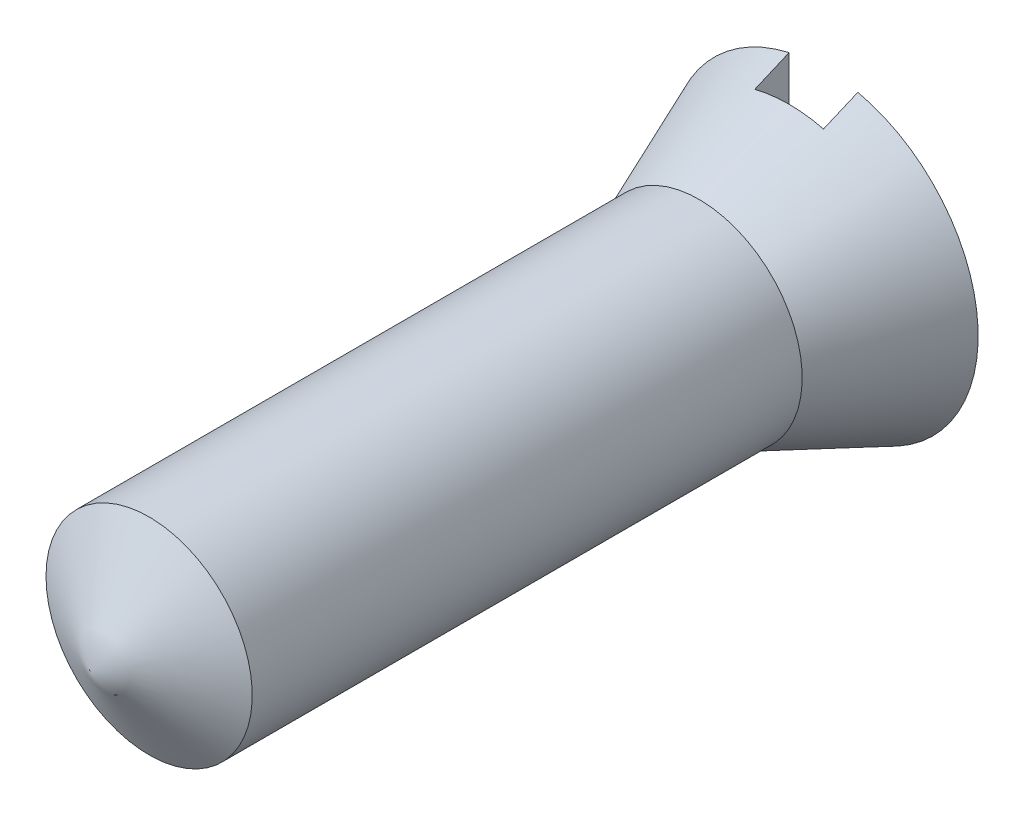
from build123d import *

# Parameters (mm, degrees)
SKETCH2_W          = 2
SKETCH2_H          = 10.452840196
CUT_EXTRUDE1_DEPTH = 1


with BuildPart() as part:
    # Sketch1 → Revolve1 (revolve)
    with BuildSketch(Plane(origin=(0, 0, 0), x_dir=(1, 0, 0), z_dir=(0, 1, 0)), mode=Mode.PRIVATE) as revolve1_sk:
        Polygon((0, 0), (0, 21.352050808), (4.5, 21.352050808), (3, 17.732050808), (3, 1.732050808), align=None)
    revolve(revolve1_sk.sketch.rotate(Axis((0, 0, 0), (0, 0, 1)), 180), axis=Axis((0, 0, 0), (0, 0, 1)))

    # Sketch2 → Cut-Extrude1 (cut)
    with BuildSketch(Plane(origin=(0, 0, -21.352050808), x_dir=(-1, 0, 0), z_dir=(0, 0, -1))):
        Rectangle(SKETCH2_W, SKETCH2_H)
    extrude(amount=-CUT_EXTRUDE1_DEPTH, mode=Mode.SUBTRACT)


solid = part.part
